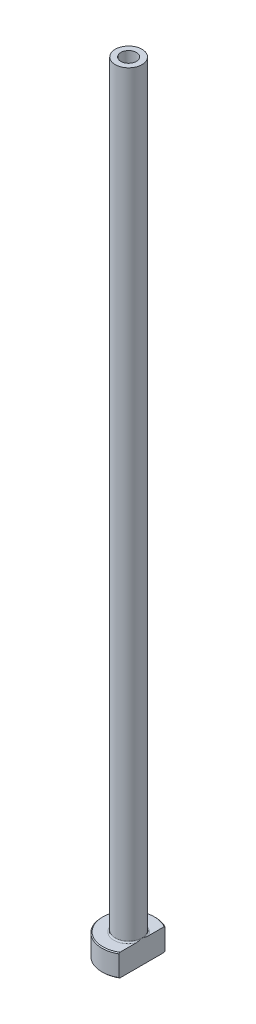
from build123d import *

# Parameters (mm, degrees)
FILLET1_R          = 0.3
CHAMFER1_SIZE      = 0.2
CUT_EXTRUDE1_DEPTH = 176.205593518
CHAMFER2_SIZE      = 0.5


with BuildPart() as part:
    # Sketch1 → Revolve1 (revolve)
    with BuildSketch(Plane.XY, mode=Mode.PRIVATE) as revolve1_sk:
        Polygon((-1.75, 175), (-3, 175), (-3, 5), (-6, 5), (-6, 0), (-2, 0), (-2, 118), (-1.75, 130), align=None)
    revolve(revolve1_sk.sketch.rotate(Axis((0, 92.187680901, 0), (0, -1, 0)), 270), axis=Axis((0, 92.187680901, 0), (0, -1, 0)))

    # Fillet1
    fillet1_edges = [part.edges().sort_by_distance(p)[0] for p in [
        (0, 5, -3),
    ]]
    fillet(fillet1_edges, radius=FILLET1_R)

    # Chamfer1
    chamfer1_edges = [part.edges().sort_by_distance(p)[0] for p in [
        (0, 0, -6),
        (0, 5, -6),
    ]]
    chamfer(chamfer1_edges, length=CHAMFER1_SIZE)

    # Sketch2 → Cut-Extrude1 (cut, through all)
    with BuildSketch(Plane.XZ):
        with BuildLine():
            Line((3, 5.196152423), (3, -5.196152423))
            ThreePointArc((3, -5.196152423), (6, 0), (3, 5.196152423))
        make_face()
    extrude(amount=-CUT_EXTRUDE1_DEPTH, mode=Mode.SUBTRACT)

    # Chamfer2
    chamfer2_edges = [part.edges().sort_by_distance(p)[0] for p in [
        (0, 0, -2),
    ]]
    chamfer(chamfer2_edges, length=CHAMFER2_SIZE)


solid = part.part
